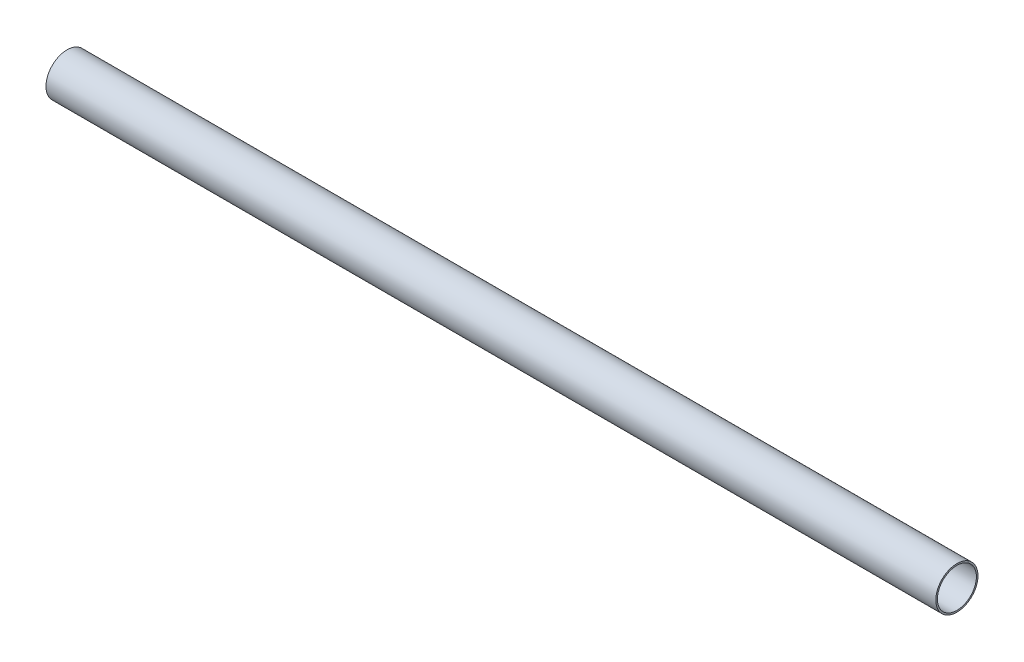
from build123d import *

# Parameters (mm, degrees)
SKETCH1_R      = 21.082
SKETCH1_R_2    = 19.4691
EXTRUDE1_DEPTH = 444.5


with BuildPart() as part:
    # Sketch1 → Extrude1 (new, symmetric)
    with BuildSketch(Plane(origin=(0, 0, 0), x_dir=(0, 0, -1), z_dir=(1, 0, 0))):
        Circle(SKETCH1_R)
        Circle(SKETCH1_R_2, mode=Mode.SUBTRACT)
    extrude(amount=EXTRUDE1_DEPTH, both=True)


solid = part.part
